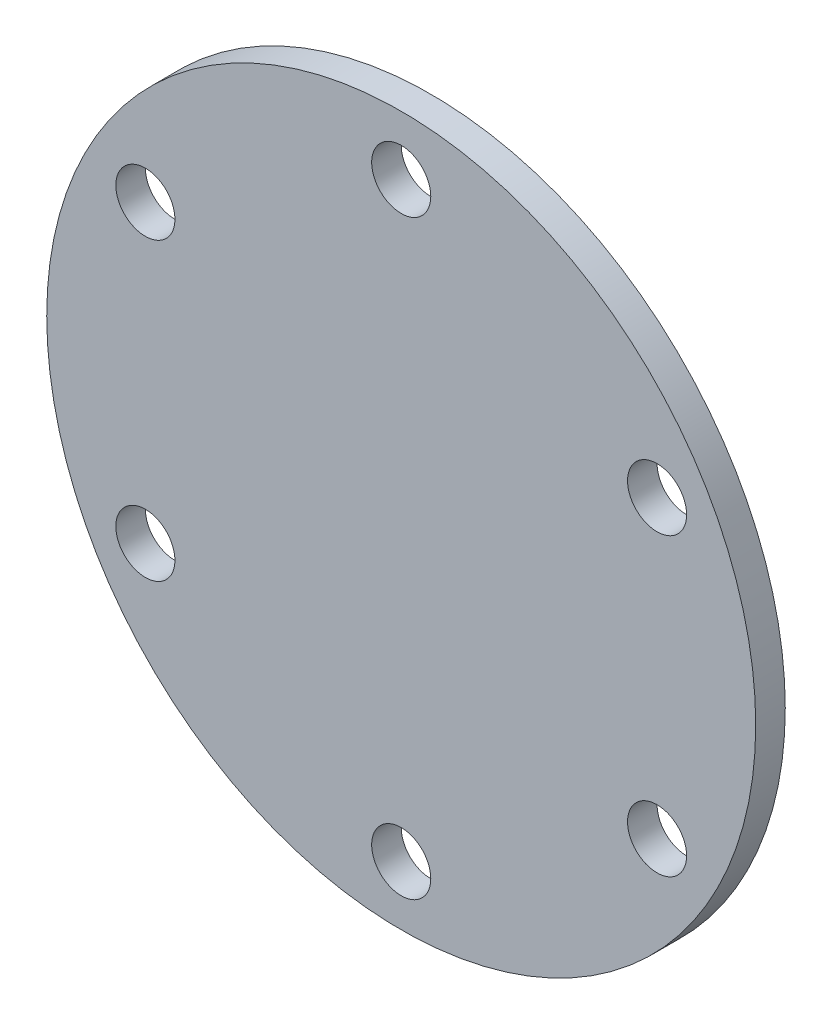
from build123d import *

# Parameters (mm, degrees)
SKETCH1_R           = 60
SKETCH1_R_2         = 5
BOSS_EXTRUDE1_DEPTH = 5


with BuildPart() as part:
    # Sketch1 → Boss-Extrude1 (new body)
    with BuildSketch(Plane.XY):
        Circle(SKETCH1_R)
        with Locations((0, 50)):
            Circle(SKETCH1_R_2, mode=Mode.SUBTRACT)
        with Locations((43.301270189, 25)):
            Circle(SKETCH1_R_2, mode=Mode.SUBTRACT)
        with Locations((43.301270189, -25)):
            Circle(SKETCH1_R_2, mode=Mode.SUBTRACT)
        with Locations((0, -50)):
            Circle(SKETCH1_R_2, mode=Mode.SUBTRACT)
        with Locations((-43.301270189, -25)):
            Circle(SKETCH1_R_2, mode=Mode.SUBTRACT)
        with Locations((-43.301270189, 25)):
            Circle(SKETCH1_R_2, mode=Mode.SUBTRACT)
    extrude(amount=BOSS_EXTRUDE1_DEPTH)


solid = part.part
